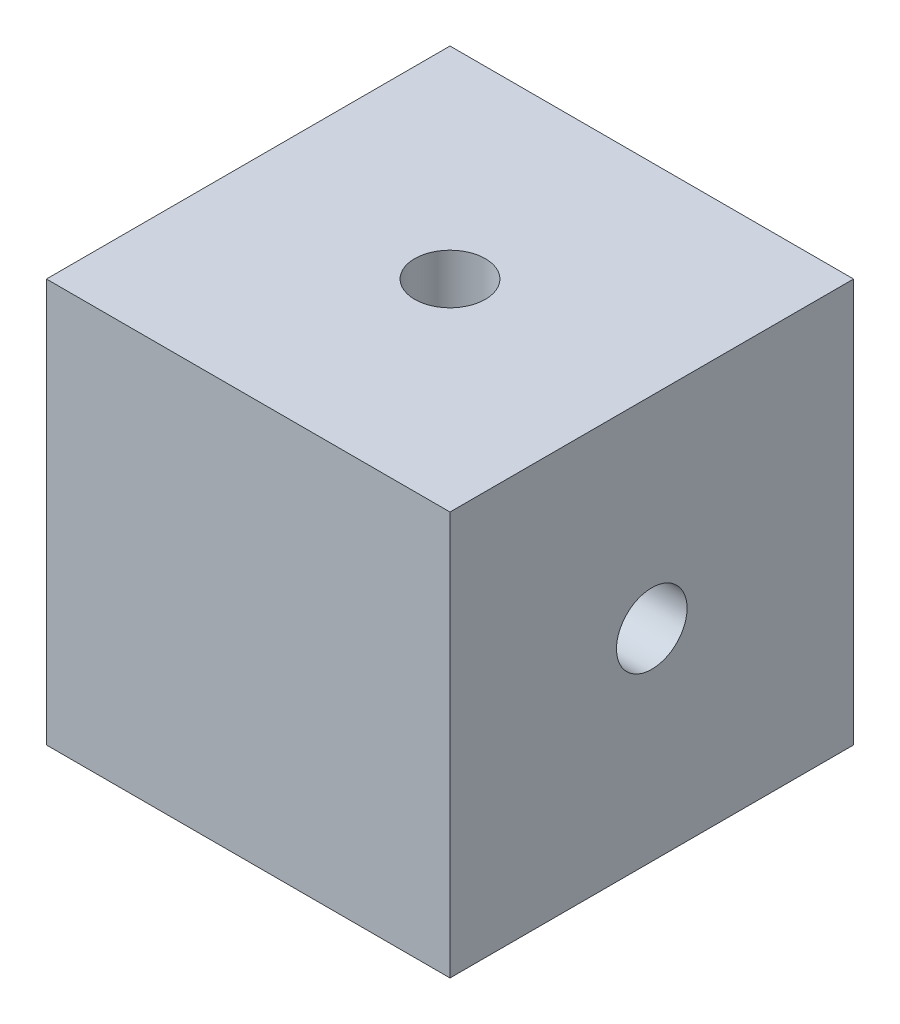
ISO-10303-21;
HEADER;
FILE_DESCRIPTION(('STEP AP214'),'2;1');
FILE_NAME('part.step','',(''),(''),'','','');
FILE_SCHEMA(('AUTOMOTIVE_DESIGN { 1 0 10303 214 1 1 1 1 }'));
ENDSEC;
DATA;
#1=APPLICATION_CONTEXT('core data for automotive mechanical design processes');
#2=APPLICATION_PROTOCOL_DEFINITION('international standard','automotive_design',2000,#1);
#3=PRODUCT_CONTEXT('',#1,'mechanical');
#4=PRODUCT('Part','Part','',(#3));
#5=PRODUCT_RELATED_PRODUCT_CATEGORY('part','',(#4));
#6=PRODUCT_DEFINITION_FORMATION('','',#4);
#7=PRODUCT_DEFINITION_CONTEXT('part definition',#1,'design');
#8=PRODUCT_DEFINITION('design','',#6,#7);
#9=PRODUCT_DEFINITION_SHAPE('','',#8);
#10=(LENGTH_UNIT() NAMED_UNIT(*) SI_UNIT(.MILLI.,.METRE.));
#11=(NAMED_UNIT(*) PLANE_ANGLE_UNIT() SI_UNIT($,.RADIAN.));
#12=(NAMED_UNIT(*) SI_UNIT($,.STERADIAN.) SOLID_ANGLE_UNIT());
#13=UNCERTAINTY_MEASURE_WITH_UNIT(LENGTH_MEASURE(1.E-05),#10,'distance_accuracy_value','');
#14=(GEOMETRIC_REPRESENTATION_CONTEXT(3) GLOBAL_UNCERTAINTY_ASSIGNED_CONTEXT((#13)) GLOBAL_UNIT_ASSIGNED_CONTEXT((#10,
#11,#12)) REPRESENTATION_CONTEXT('',''));
#15=CARTESIAN_POINT('',(0.,0.,0.));
#16=DIRECTION('',(0.,0.,1.));
#17=DIRECTION('',(1.,0.,0.));
#18=AXIS2_PLACEMENT_3D('',#15,#16,#17);
#19=CARTESIAN_POINT('',(10.,20.,-10.));
#20=DIRECTION('',(0.,-1.,0.));
#21=DIRECTION('',(0.,0.,-1.));
#22=AXIS2_PLACEMENT_3D('',#19,#20,#21);
#23=CYLINDRICAL_SURFACE('',#22,1.75);
#24=CARTESIAN_POINT('',(10.,10.,-10.));
#25=DIRECTION('',(0.707106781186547,-0.707106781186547,0.));
#26=DIRECTION('',(-0.707106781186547,-0.707106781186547,0.));
#27=AXIS2_PLACEMENT_3D('',#24,#25,#26);
#28=ELLIPSE('',#27,2.47487373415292,1.75);
#29=CARTESIAN_POINT('',(10.,10.,-8.25));
#30=VERTEX_POINT('',#29);
#31=CARTESIAN_POINT('',(10.,10.,-11.75));
#32=VERTEX_POINT('',#31);
#33=EDGE_CURVE('E11',#30,#32,#28,.F.);
#34=ORIENTED_EDGE('',*,*,#33,.F.);
#35=CARTESIAN_POINT('',(10.,10.,-10.));
#36=DIRECTION('',(-0.707106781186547,-0.707106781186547,0.));
#37=DIRECTION('',(0.707106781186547,-0.707106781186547,0.));
#38=AXIS2_PLACEMENT_3D('',#35,#36,#37);
#39=ELLIPSE('',#38,2.47487373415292,1.75);
#40=EDGE_CURVE('E44',#32,#30,#39,.F.);
#41=ORIENTED_EDGE('',*,*,#40,.F.);
#42=EDGE_LOOP('',(#34,#41));
#43=FACE_BOUND('',#42,.T.);
#44=CARTESIAN_POINT('',(10.,20.,-10.));
#45=DIRECTION('',(0.,1.,0.));
#46=DIRECTION('',(0.,0.,1.));
#47=AXIS2_PLACEMENT_3D('',#44,#45,#46);
#48=CIRCLE('',#47,1.75);
#49=CARTESIAN_POINT('',(10.,20.,-8.25));
#50=VERTEX_POINT('',#49);
#51=EDGE_CURVE('E119',#50,#50,#48,.T.);
#52=ORIENTED_EDGE('',*,*,#51,.T.);
#53=EDGE_LOOP('',(#52));
#54=FACE_BOUND('',#53,.T.);
#55=ADVANCED_FACE('F30',(#43,#54),#23,.F.);
#56=CARTESIAN_POINT('',(0.,20.,-20.));
#57=DIRECTION('',(0.,-1.,0.));
#58=DIRECTION('',(0.,0.,-1.));
#59=AXIS2_PLACEMENT_3D('',#56,#57,#58);
#60=PLANE('',#59);
#61=DIRECTION('',(0.,0.,1.));
#62=VECTOR('',#61,1.);
#63=CARTESIAN_POINT('',(0.,20.,0.));
#64=LINE('',#63,#62);
#65=CARTESIAN_POINT('',(0.,20.,-20.));
#66=VERTEX_POINT('',#65);
#67=CARTESIAN_POINT('',(0.,20.,0.));
#68=VERTEX_POINT('',#67);
#69=EDGE_CURVE('E111',#66,#68,#64,.T.);
#70=ORIENTED_EDGE('',*,*,#69,.T.);
#71=DIRECTION('',(1.,0.,0.));
#72=VECTOR('',#71,1.);
#73=CARTESIAN_POINT('',(0.,20.,0.));
#74=LINE('',#73,#72);
#75=CARTESIAN_POINT('',(20.,20.,0.));
#76=VERTEX_POINT('',#75);
#77=EDGE_CURVE('E82',#68,#76,#74,.T.);
#78=ORIENTED_EDGE('',*,*,#77,.T.);
#79=DIRECTION('',(0.,0.,-1.));
#80=VECTOR('',#79,1.);
#81=CARTESIAN_POINT('',(20.,20.,0.));
#82=LINE('',#81,#80);
#83=CARTESIAN_POINT('',(20.,20.,-20.));
#84=VERTEX_POINT('',#83);
#85=EDGE_CURVE('E121',#76,#84,#82,.T.);
#86=ORIENTED_EDGE('',*,*,#85,.T.);
#87=DIRECTION('',(-1.,0.,0.));
#88=VECTOR('',#87,1.);
#89=CARTESIAN_POINT('',(0.,20.,-20.));
#90=LINE('',#89,#88);
#91=EDGE_CURVE('E53',#84,#66,#90,.T.);
#92=ORIENTED_EDGE('',*,*,#91,.T.);
#93=EDGE_LOOP('',(#70,#78,#86,#92));
#94=FACE_BOUND('',#93,.T.);
#95=ORIENTED_EDGE('',*,*,#51,.F.);
#96=EDGE_LOOP('',(#95));
#97=FACE_BOUND('',#96,.T.);
#98=ADVANCED_FACE('F147',(#94,#97),#60,.F.);
#99=CARTESIAN_POINT('',(0.,0.,-20.));
#100=DIRECTION('',(0.,-1.,0.));
#101=DIRECTION('',(0.,0.,-1.));
#102=AXIS2_PLACEMENT_3D('',#99,#100,#101);
#103=PLANE('',#102);
#104=DIRECTION('',(0.,0.,1.));
#105=VECTOR('',#104,1.);
#106=CARTESIAN_POINT('',(0.,0.,0.));
#107=LINE('',#106,#105);
#108=CARTESIAN_POINT('',(0.,0.,-20.));
#109=VERTEX_POINT('',#108);
#110=CARTESIAN_POINT('',(0.,0.,0.));
#111=VERTEX_POINT('',#110);
#112=EDGE_CURVE('E116',#109,#111,#107,.T.);
#113=ORIENTED_EDGE('',*,*,#112,.F.);
#114=DIRECTION('',(-1.,0.,0.));
#115=VECTOR('',#114,1.);
#116=CARTESIAN_POINT('',(0.,0.,-20.));
#117=LINE('',#116,#115);
#118=CARTESIAN_POINT('',(20.,0.,-20.));
#119=VERTEX_POINT('',#118);
#120=EDGE_CURVE('E74',#119,#109,#117,.T.);
#121=ORIENTED_EDGE('',*,*,#120,.F.);
#122=DIRECTION('',(0.,0.,-1.));
#123=VECTOR('',#122,1.);
#124=CARTESIAN_POINT('',(20.,0.,0.));
#125=LINE('',#124,#123);
#126=CARTESIAN_POINT('',(20.,0.,0.));
#127=VERTEX_POINT('',#126);
#128=EDGE_CURVE('E112',#127,#119,#125,.T.);
#129=ORIENTED_EDGE('',*,*,#128,.F.);
#130=DIRECTION('',(1.,0.,0.));
#131=VECTOR('',#130,1.);
#132=CARTESIAN_POINT('',(0.,0.,0.));
#133=LINE('',#132,#131);
#134=EDGE_CURVE('E114',#111,#127,#133,.T.);
#135=ORIENTED_EDGE('',*,*,#134,.F.);
#136=EDGE_LOOP('',(#113,#121,#129,#135));
#137=FACE_BOUND('',#136,.T.);
#138=CARTESIAN_POINT('',(10.,0.,-10.));
#139=DIRECTION('',(0.,1.,0.));
#140=DIRECTION('',(0.,0.,1.));
#141=AXIS2_PLACEMENT_3D('',#138,#139,#140);
#142=CIRCLE('',#141,1.75);
#143=CARTESIAN_POINT('',(10.,0.,-8.25));
#144=VERTEX_POINT('',#143);
#145=EDGE_CURVE('E125',#144,#144,#142,.T.);
#146=ORIENTED_EDGE('',*,*,#145,.T.);
#147=EDGE_LOOP('',(#146));
#148=FACE_BOUND('',#147,.T.);
#149=ADVANCED_FACE('F151',(#137,#148),#103,.T.);
#150=CARTESIAN_POINT('',(0.,20.,0.));
#151=DIRECTION('',(1.,0.,0.));
#152=DIRECTION('',(0.,0.,-1.));
#153=AXIS2_PLACEMENT_3D('',#150,#151,#152);
#154=PLANE('',#153);
#155=CARTESIAN_POINT('',(0.,10.,-10.));
#156=DIRECTION('',(1.,0.,0.));
#157=DIRECTION('',(0.,0.,-1.));
#158=AXIS2_PLACEMENT_3D('',#155,#156,#157);
#159=CIRCLE('',#158,1.75);
#160=CARTESIAN_POINT('',(0.,10.,-11.75));
#161=VERTEX_POINT('',#160);
#162=EDGE_CURVE('E128',#161,#161,#159,.T.);
#163=ORIENTED_EDGE('',*,*,#162,.T.);
#164=EDGE_LOOP('',(#163));
#165=FACE_BOUND('',#164,.T.);
#166=ORIENTED_EDGE('',*,*,#112,.T.);
#167=DIRECTION('',(0.,-1.,0.));
#168=VECTOR('',#167,1.);
#169=CARTESIAN_POINT('',(0.,20.,0.));
#170=LINE('',#169,#168);
#171=EDGE_CURVE('E96',#68,#111,#170,.T.);
#172=ORIENTED_EDGE('',*,*,#171,.F.);
#173=ORIENTED_EDGE('',*,*,#69,.F.);
#174=DIRECTION('',(0.,-1.,0.));
#175=VECTOR('',#174,1.);
#176=CARTESIAN_POINT('',(0.,20.,-20.));
#177=LINE('',#176,#175);
#178=EDGE_CURVE('E108',#66,#109,#177,.T.);
#179=ORIENTED_EDGE('',*,*,#178,.T.);
#180=EDGE_LOOP('',(#166,#172,#173,#179));
#181=FACE_BOUND('',#180,.T.);
#182=ADVANCED_FACE('F32',(#165,#181),#154,.F.);
#183=CARTESIAN_POINT('',(0.,20.,0.));
#184=DIRECTION('',(0.,0.,-1.));
#185=DIRECTION('',(-1.,0.,0.));
#186=AXIS2_PLACEMENT_3D('',#183,#184,#185);
#187=PLANE('',#186);
#188=ORIENTED_EDGE('',*,*,#134,.T.);
#189=DIRECTION('',(0.,-1.,0.));
#190=VECTOR('',#189,1.);
#191=CARTESIAN_POINT('',(20.,20.,0.));
#192=LINE('',#191,#190);
#193=EDGE_CURVE('E103',#76,#127,#192,.T.);
#194=ORIENTED_EDGE('',*,*,#193,.F.);
#195=ORIENTED_EDGE('',*,*,#77,.F.);
#196=ORIENTED_EDGE('',*,*,#171,.T.);
#197=EDGE_LOOP('',(#188,#194,#195,#196));
#198=FACE_BOUND('',#197,.T.);
#199=ADVANCED_FACE('F161',(#198),#187,.F.);
#200=CARTESIAN_POINT('',(20.,20.,0.));
#201=DIRECTION('',(-1.,0.,0.));
#202=DIRECTION('',(0.,0.,1.));
#203=AXIS2_PLACEMENT_3D('',#200,#201,#202);
#204=PLANE('',#203);
#205=CARTESIAN_POINT('',(20.,10.,-10.));
#206=DIRECTION('',(1.,0.,0.));
#207=DIRECTION('',(0.,0.,-1.));
#208=AXIS2_PLACEMENT_3D('',#205,#206,#207);
#209=CIRCLE('',#208,1.75);
#210=CARTESIAN_POINT('',(20.,10.,-11.75));
#211=VERTEX_POINT('',#210);
#212=EDGE_CURVE('E131',#211,#211,#209,.T.);
#213=ORIENTED_EDGE('',*,*,#212,.F.);
#214=EDGE_LOOP('',(#213));
#215=FACE_BOUND('',#214,.T.);
#216=ORIENTED_EDGE('',*,*,#128,.T.);
#217=DIRECTION('',(0.,-1.,0.));
#218=VECTOR('',#217,1.);
#219=CARTESIAN_POINT('',(20.,20.,-20.));
#220=LINE('',#219,#218);
#221=EDGE_CURVE('E106',#84,#119,#220,.T.);
#222=ORIENTED_EDGE('',*,*,#221,.F.);
#223=ORIENTED_EDGE('',*,*,#85,.F.);
#224=ORIENTED_EDGE('',*,*,#193,.T.);
#225=EDGE_LOOP('',(#216,#222,#223,#224));
#226=FACE_BOUND('',#225,.T.);
#227=ADVANCED_FACE('F159',(#215,#226),#204,.F.);
#228=CARTESIAN_POINT('',(0.,20.,-20.));
#229=DIRECTION('',(0.,0.,1.));
#230=DIRECTION('',(1.,0.,0.));
#231=AXIS2_PLACEMENT_3D('',#228,#229,#230);
#232=PLANE('',#231);
#233=ORIENTED_EDGE('',*,*,#120,.T.);
#234=ORIENTED_EDGE('',*,*,#178,.F.);
#235=ORIENTED_EDGE('',*,*,#91,.F.);
#236=ORIENTED_EDGE('',*,*,#221,.T.);
#237=EDGE_LOOP('',(#233,#234,#235,#236));
#238=FACE_BOUND('',#237,.T.);
#239=ADVANCED_FACE('F144',(#238),#232,.F.);
#240=CARTESIAN_POINT('',(10.,10.,-10.));
#241=DIRECTION('',(0.707106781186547,-0.707106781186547,0.));
#242=DIRECTION('',(-0.707106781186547,-0.707106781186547,0.));
#243=AXIS2_PLACEMENT_3D('',#240,#241,#242);
#244=ELLIPSE('',#243,2.47487373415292,1.75);
#245=EDGE_CURVE('E38',#30,#32,#244,.T.);
#246=ORIENTED_EDGE('',*,*,#245,.F.);
#247=CARTESIAN_POINT('',(10.,10.,-10.));
#248=DIRECTION('',(-0.707106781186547,-0.707106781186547,0.));
#249=DIRECTION('',(0.707106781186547,-0.707106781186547,0.));
#250=AXIS2_PLACEMENT_3D('',#247,#248,#249);
#251=ELLIPSE('',#250,2.47487373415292,1.75);
#252=EDGE_CURVE('E87',#32,#30,#251,.T.);
#253=ORIENTED_EDGE('',*,*,#252,.F.);
#254=EDGE_LOOP('',(#246,#253));
#255=FACE_BOUND('',#254,.T.);
#256=ORIENTED_EDGE('',*,*,#145,.F.);
#257=EDGE_LOOP('',(#256));
#258=FACE_BOUND('',#257,.T.);
#259=ADVANCED_FACE('F99',(#255,#258),#23,.F.);
#260=CARTESIAN_POINT('',(0.,10.,-10.));
#261=DIRECTION('',(1.,0.,0.));
#262=DIRECTION('',(0.,0.,-1.));
#263=AXIS2_PLACEMENT_3D('',#260,#261,#262);
#264=CYLINDRICAL_SURFACE('',#263,1.75);
#265=ORIENTED_EDGE('',*,*,#245,.T.);
#266=ORIENTED_EDGE('',*,*,#40,.T.);
#267=EDGE_LOOP('',(#265,#266));
#268=FACE_BOUND('',#267,.T.);
#269=ORIENTED_EDGE('',*,*,#162,.F.);
#270=EDGE_LOOP('',(#269));
#271=FACE_BOUND('',#270,.T.);
#272=ADVANCED_FACE('F94',(#268,#271),#264,.F.);
#273=ORIENTED_EDGE('',*,*,#33,.T.);
#274=ORIENTED_EDGE('',*,*,#252,.T.);
#275=EDGE_LOOP('',(#273,#274));
#276=FACE_BOUND('',#275,.T.);
#277=ORIENTED_EDGE('',*,*,#212,.T.);
#278=EDGE_LOOP('',(#277));
#279=FACE_BOUND('',#278,.T.);
#280=ADVANCED_FACE('F88',(#276,#279),#264,.F.);
#281=CLOSED_SHELL('',(#55,#98,#149,#182,#199,#227,#239,#259,#272,#280));
#282=MANIFOLD_SOLID_BREP('B2',#281);
#283=ADVANCED_BREP_SHAPE_REPRESENTATION('',(#18,#282),#14);
#284=SHAPE_DEFINITION_REPRESENTATION(#9,#283);
ENDSEC;
END-ISO-10303-21;
